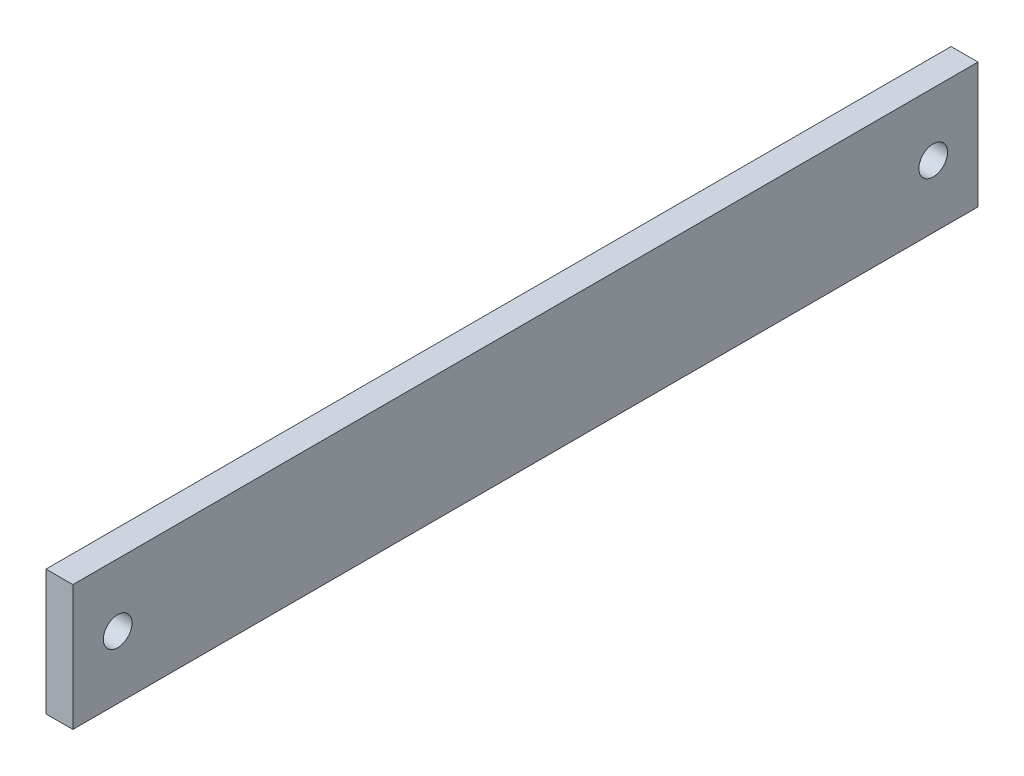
ISO-10303-21;
HEADER;
FILE_DESCRIPTION(('STEP AP214'),'2;1');
FILE_NAME('part.step','',(''),(''),'','','');
FILE_SCHEMA(('AUTOMOTIVE_DESIGN { 1 0 10303 214 1 1 1 1 }'));
ENDSEC;
DATA;
#1=APPLICATION_CONTEXT('core data for automotive mechanical design processes');
#2=APPLICATION_PROTOCOL_DEFINITION('international standard','automotive_design',2000,#1);
#3=PRODUCT_CONTEXT('',#1,'mechanical');
#4=PRODUCT('Part','Part','',(#3));
#5=PRODUCT_RELATED_PRODUCT_CATEGORY('part','',(#4));
#6=PRODUCT_DEFINITION_FORMATION('','',#4);
#7=PRODUCT_DEFINITION_CONTEXT('part definition',#1,'design');
#8=PRODUCT_DEFINITION('design','',#6,#7);
#9=PRODUCT_DEFINITION_SHAPE('','',#8);
#10=(LENGTH_UNIT() NAMED_UNIT(*) SI_UNIT(.MILLI.,.METRE.));
#11=(NAMED_UNIT(*) PLANE_ANGLE_UNIT() SI_UNIT($,.RADIAN.));
#12=(NAMED_UNIT(*) SI_UNIT($,.STERADIAN.) SOLID_ANGLE_UNIT());
#13=UNCERTAINTY_MEASURE_WITH_UNIT(LENGTH_MEASURE(1.E-05),#10,'distance_accuracy_value','');
#14=(GEOMETRIC_REPRESENTATION_CONTEXT(3) GLOBAL_UNCERTAINTY_ASSIGNED_CONTEXT((#13)) GLOBAL_UNIT_ASSIGNED_CONTEXT((#10,
#11,#12)) REPRESENTATION_CONTEXT('',''));
#15=CARTESIAN_POINT('',(0.,0.,0.));
#16=DIRECTION('',(0.,0.,1.));
#17=DIRECTION('',(1.,0.,0.));
#18=AXIS2_PLACEMENT_3D('',#15,#16,#17);
#19=CARTESIAN_POINT('',(1.49999999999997,24.4814087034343,-50.51));
#20=DIRECTION('',(-1.,0.,0.));
#21=DIRECTION('',(0.,0.,1.));
#22=AXIS2_PLACEMENT_3D('',#19,#20,#21);
#23=PLANE('',#22);
#24=DIRECTION('',(0.,0.,-1.));
#25=VECTOR('',#24,1.);
#26=CARTESIAN_POINT('',(1.49999999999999,14.,-40.5));
#27=LINE('',#26,#25);
#28=CARTESIAN_POINT('',(1.49999999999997,14.,50.5));
#29=VERTEX_POINT('',#28);
#30=CARTESIAN_POINT('',(1.49999999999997,14.,-50.5));
#31=VERTEX_POINT('',#30);
#32=EDGE_CURVE('E41',#29,#31,#27,.T.);
#33=ORIENTED_EDGE('',*,*,#32,.F.);
#34=DIRECTION('',(0.,1.,0.));
#35=VECTOR('',#34,1.);
#36=CARTESIAN_POINT('',(1.49999999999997,14.,50.5));
#37=LINE('',#36,#35);
#38=CARTESIAN_POINT('',(1.49999999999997,0.,50.5));
#39=VERTEX_POINT('',#38);
#40=EDGE_CURVE('E83',#39,#29,#37,.T.);
#41=ORIENTED_EDGE('',*,*,#40,.F.);
#42=DIRECTION('',(0.,0.,-1.));
#43=VECTOR('',#42,1.);
#44=CARTESIAN_POINT('',(1.49999999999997,0.,0.));
#45=LINE('',#44,#43);
#46=CARTESIAN_POINT('',(1.49999999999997,0.,-50.5));
#47=VERTEX_POINT('',#46);
#48=EDGE_CURVE('E86',#39,#47,#45,.T.);
#49=ORIENTED_EDGE('',*,*,#48,.T.);
#50=DIRECTION('',(0.,-1.,0.));
#51=VECTOR('',#50,1.);
#52=CARTESIAN_POINT('',(1.49999999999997,14.,-50.5));
#53=LINE('',#52,#51);
#54=EDGE_CURVE('E75',#31,#47,#53,.T.);
#55=ORIENTED_EDGE('',*,*,#54,.F.);
#56=EDGE_LOOP('',(#33,#41,#49,#55));
#57=FACE_BOUND('',#56,.T.);
#58=CARTESIAN_POINT('',(1.49999999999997,7.,45.5));
#59=DIRECTION('',(-1.,0.,0.));
#60=DIRECTION('',(0.,0.,1.));
#61=AXIS2_PLACEMENT_3D('',#58,#59,#60);
#62=CIRCLE('',#61,1.6);
#63=CARTESIAN_POINT('',(1.49999999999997,7.,47.1));
#64=VERTEX_POINT('',#63);
#65=EDGE_CURVE('E103',#64,#64,#62,.F.);
#66=ORIENTED_EDGE('',*,*,#65,.F.);
#67=EDGE_LOOP('',(#66));
#68=FACE_BOUND('',#67,.T.);
#69=CARTESIAN_POINT('',(1.49999999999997,7.,-45.5));
#70=DIRECTION('',(-1.,0.,0.));
#71=DIRECTION('',(0.,0.,1.));
#72=AXIS2_PLACEMENT_3D('',#69,#70,#71);
#73=CIRCLE('',#72,1.6);
#74=CARTESIAN_POINT('',(1.49999999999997,7.,-43.9));
#75=VERTEX_POINT('',#74);
#76=EDGE_CURVE('E146',#75,#75,#73,.F.);
#77=ORIENTED_EDGE('',*,*,#76,.F.);
#78=EDGE_LOOP('',(#77));
#79=FACE_BOUND('',#78,.T.);
#80=ADVANCED_FACE('F32',(#57,#68,#79),#23,.F.);
#81=CARTESIAN_POINT('',(-1.50000000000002,24.4814087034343,-50.51));
#82=DIRECTION('',(-1.,0.,0.));
#83=DIRECTION('',(0.,0.,1.));
#84=AXIS2_PLACEMENT_3D('',#81,#82,#83);
#85=PLANE('',#84);
#86=DIRECTION('',(0.,1.,0.));
#87=VECTOR('',#86,1.);
#88=CARTESIAN_POINT('',(-1.50000000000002,14.,50.5));
#89=LINE('',#88,#87);
#90=CARTESIAN_POINT('',(-1.50000000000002,0.,50.5));
#91=VERTEX_POINT('',#90);
#92=CARTESIAN_POINT('',(-1.50000000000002,14.,50.5));
#93=VERTEX_POINT('',#92);
#94=EDGE_CURVE('E104',#91,#93,#89,.T.);
#95=ORIENTED_EDGE('',*,*,#94,.T.);
#96=DIRECTION('',(0.,0.,-1.));
#97=VECTOR('',#96,1.);
#98=CARTESIAN_POINT('',(-1.5,14.,-40.5));
#99=LINE('',#98,#97);
#100=CARTESIAN_POINT('',(-1.50000000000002,14.,-50.5));
#101=VERTEX_POINT('',#100);
#102=EDGE_CURVE('E11',#93,#101,#99,.T.);
#103=ORIENTED_EDGE('',*,*,#102,.T.);
#104=DIRECTION('',(0.,-1.,0.));
#105=VECTOR('',#104,1.);
#106=CARTESIAN_POINT('',(-1.50000000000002,14.,-50.5));
#107=LINE('',#106,#105);
#108=CARTESIAN_POINT('',(-1.50000000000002,0.,-50.5));
#109=VERTEX_POINT('',#108);
#110=EDGE_CURVE('E90',#101,#109,#107,.T.);
#111=ORIENTED_EDGE('',*,*,#110,.T.);
#112=DIRECTION('',(0.,0.,-1.));
#113=VECTOR('',#112,1.);
#114=CARTESIAN_POINT('',(-1.50000000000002,0.,0.));
#115=LINE('',#114,#113);
#116=EDGE_CURVE('E49',#91,#109,#115,.T.);
#117=ORIENTED_EDGE('',*,*,#116,.F.);
#118=EDGE_LOOP('',(#95,#103,#111,#117));
#119=FACE_BOUND('',#118,.T.);
#120=CARTESIAN_POINT('',(-1.50000000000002,7.,-45.5));
#121=DIRECTION('',(-1.,0.,0.));
#122=DIRECTION('',(0.,0.,1.));
#123=AXIS2_PLACEMENT_3D('',#120,#121,#122);
#124=CIRCLE('',#123,1.6);
#125=CARTESIAN_POINT('',(-1.50000000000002,7.,-43.9));
#126=VERTEX_POINT('',#125);
#127=EDGE_CURVE('E91',#126,#126,#124,.F.);
#128=ORIENTED_EDGE('',*,*,#127,.T.);
#129=EDGE_LOOP('',(#128));
#130=FACE_BOUND('',#129,.T.);
#131=CARTESIAN_POINT('',(-1.50000000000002,7.,45.5));
#132=DIRECTION('',(-1.,0.,0.));
#133=DIRECTION('',(0.,0.,1.));
#134=AXIS2_PLACEMENT_3D('',#131,#132,#133);
#135=CIRCLE('',#134,1.6);
#136=CARTESIAN_POINT('',(-1.50000000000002,7.,47.1));
#137=VERTEX_POINT('',#136);
#138=EDGE_CURVE('E36',#137,#137,#135,.F.);
#139=ORIENTED_EDGE('',*,*,#138,.T.);
#140=EDGE_LOOP('',(#139));
#141=FACE_BOUND('',#140,.T.);
#142=ADVANCED_FACE('F112',(#119,#130,#141),#85,.T.);
#143=CARTESIAN_POINT('',(-34.5,14.,-50.5));
#144=DIRECTION('',(0.,0.,1.));
#145=DIRECTION('',(1.,0.,0.));
#146=AXIS2_PLACEMENT_3D('',#143,#144,#145);
#147=PLANE('',#146);
#148=ORIENTED_EDGE('',*,*,#110,.F.);
#149=DIRECTION('',(-1.,0.,0.));
#150=VECTOR('',#149,1.);
#151=CARTESIAN_POINT('',(-34.5,14.,-50.5));
#152=LINE('',#151,#150);
#153=EDGE_CURVE('E81',#31,#101,#152,.T.);
#154=ORIENTED_EDGE('',*,*,#153,.F.);
#155=ORIENTED_EDGE('',*,*,#54,.T.);
#156=DIRECTION('',(-1.,0.,0.));
#157=VECTOR('',#156,1.);
#158=CARTESIAN_POINT('',(-34.5,0.,-50.5));
#159=LINE('',#158,#157);
#160=EDGE_CURVE('E79',#47,#109,#159,.T.);
#161=ORIENTED_EDGE('',*,*,#160,.T.);
#162=EDGE_LOOP('',(#148,#154,#155,#161));
#163=FACE_BOUND('',#162,.T.);
#164=ADVANCED_FACE('F78',(#163),#147,.F.);
#165=CARTESIAN_POINT('',(-34.5,14.,50.5));
#166=DIRECTION('',(0.,0.,-1.));
#167=DIRECTION('',(-1.,0.,0.));
#168=AXIS2_PLACEMENT_3D('',#165,#166,#167);
#169=PLANE('',#168);
#170=ORIENTED_EDGE('',*,*,#94,.F.);
#171=DIRECTION('',(1.,0.,0.));
#172=VECTOR('',#171,1.);
#173=CARTESIAN_POINT('',(-34.5,0.,50.5));
#174=LINE('',#173,#172);
#175=EDGE_CURVE('E94',#91,#39,#174,.T.);
#176=ORIENTED_EDGE('',*,*,#175,.T.);
#177=ORIENTED_EDGE('',*,*,#40,.T.);
#178=DIRECTION('',(1.,0.,0.));
#179=VECTOR('',#178,1.);
#180=CARTESIAN_POINT('',(-34.5,14.,50.5));
#181=LINE('',#180,#179);
#182=EDGE_CURVE('E95',#93,#29,#181,.T.);
#183=ORIENTED_EDGE('',*,*,#182,.F.);
#184=EDGE_LOOP('',(#170,#176,#177,#183));
#185=FACE_BOUND('',#184,.T.);
#186=ADVANCED_FACE('F134',(#185),#169,.F.);
#187=CARTESIAN_POINT('',(0.,14.,0.));
#188=DIRECTION('',(0.,-1.,0.));
#189=DIRECTION('',(0.,0.,-1.));
#190=AXIS2_PLACEMENT_3D('',#187,#188,#189);
#191=PLANE('',#190);
#192=ORIENTED_EDGE('',*,*,#102,.F.);
#193=ORIENTED_EDGE('',*,*,#182,.T.);
#194=ORIENTED_EDGE('',*,*,#32,.T.);
#195=ORIENTED_EDGE('',*,*,#153,.T.);
#196=EDGE_LOOP('',(#192,#193,#194,#195));
#197=FACE_BOUND('',#196,.T.);
#198=ADVANCED_FACE('F122',(#197),#191,.F.);
#199=CARTESIAN_POINT('',(0.,0.,0.));
#200=DIRECTION('',(0.,-1.,0.));
#201=DIRECTION('',(0.,0.,-1.));
#202=AXIS2_PLACEMENT_3D('',#199,#200,#201);
#203=PLANE('',#202);
#204=ORIENTED_EDGE('',*,*,#175,.F.);
#205=ORIENTED_EDGE('',*,*,#116,.T.);
#206=ORIENTED_EDGE('',*,*,#160,.F.);
#207=ORIENTED_EDGE('',*,*,#48,.F.);
#208=EDGE_LOOP('',(#204,#205,#206,#207));
#209=FACE_BOUND('',#208,.T.);
#210=ADVANCED_FACE('F93',(#209),#203,.T.);
#211=CARTESIAN_POINT('',(-34.5,7.,45.5));
#212=DIRECTION('',(1.,0.,0.));
#213=DIRECTION('',(0.,0.,-1.));
#214=AXIS2_PLACEMENT_3D('',#211,#212,#213);
#215=CYLINDRICAL_SURFACE('',#214,1.6);
#216=ORIENTED_EDGE('',*,*,#65,.T.);
#217=EDGE_LOOP('',(#216));
#218=FACE_BOUND('',#217,.T.);
#219=ORIENTED_EDGE('',*,*,#138,.F.);
#220=EDGE_LOOP('',(#219));
#221=FACE_BOUND('',#220,.T.);
#222=ADVANCED_FACE('F114',(#218,#221),#215,.F.);
#223=CARTESIAN_POINT('',(-34.5,7.,-45.5));
#224=DIRECTION('',(1.,0.,0.));
#225=DIRECTION('',(0.,0.,-1.));
#226=AXIS2_PLACEMENT_3D('',#223,#224,#225);
#227=CYLINDRICAL_SURFACE('',#226,1.6);
#228=ORIENTED_EDGE('',*,*,#76,.T.);
#229=EDGE_LOOP('',(#228));
#230=FACE_BOUND('',#229,.T.);
#231=ORIENTED_EDGE('',*,*,#127,.F.);
#232=EDGE_LOOP('',(#231));
#233=FACE_BOUND('',#232,.T.);
#234=ADVANCED_FACE('F34',(#230,#233),#227,.F.);
#235=CLOSED_SHELL('',(#80,#142,#164,#186,#198,#210,#222,#234));
#236=MANIFOLD_SOLID_BREP('B2',#235);
#237=ADVANCED_BREP_SHAPE_REPRESENTATION('',(#18,#236),#14);
#238=SHAPE_DEFINITION_REPRESENTATION(#9,#237);
ENDSEC;
END-ISO-10303-21;
